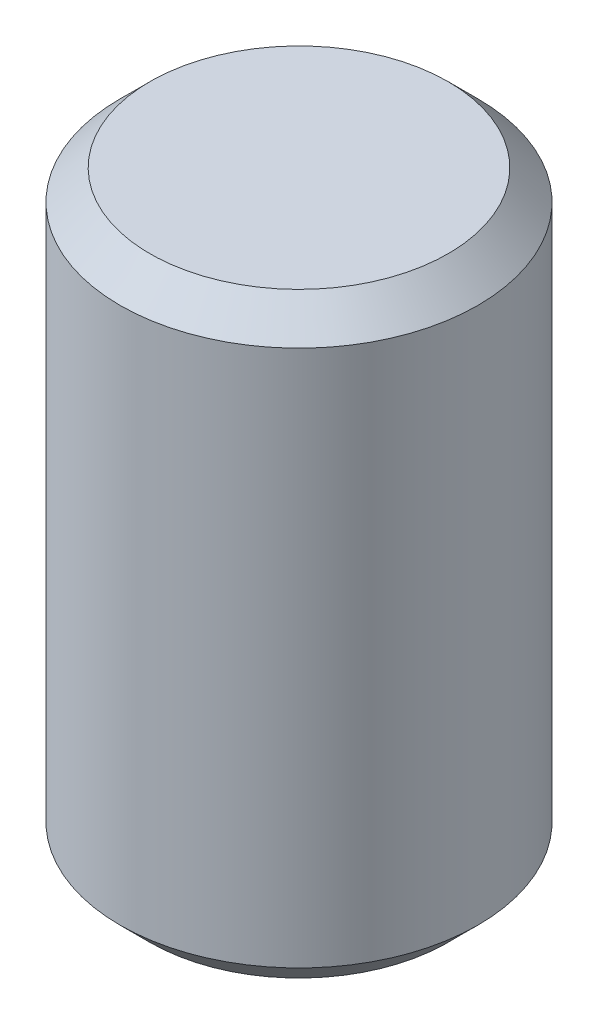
from build123d import *

# Parameters (mm, degrees)
ESQUISSE1_W             = 3
ESQUISSE1_H             = 10
CHANFREIN1_SIZE         = 0.5
ENL_V_MAT_EXTRU_1_DEPTH = 4


with BuildPart() as part:
    # Esquisse1 → Base-R_volution (revolve)
    with BuildSketch(Plane.XY, mode=Mode.PRIVATE) as base_r_volution_sk:
        with Locations((1.5, 5)):
            Rectangle(ESQUISSE1_W, ESQUISSE1_H)
    revolve(base_r_volution_sk.sketch.rotate(Axis((0, 10, 0), (0, -1, 0)), 90), axis=Axis((0, 10, 0), (0, -1, 0)))

    # Chanfrein1
    chanfrein1_edges = [part.edges().sort_by_distance(p)[0] for p in [
        (0, 10, -3),
        (0, 0, -3),
    ]]
    chamfer(chanfrein1_edges, length=CHANFREIN1_SIZE)

    # Esquisse2 → Enl_v. mat.-Extru.1 (cut)
    with BuildSketch(Plane.XZ):
        Polygon((0, -1.732050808), (1.5, -0.866025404), (1.5, 0.866025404), (0, 1.732050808), (-1.5, 0.866025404), (-1.5, -0.866025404), align=None)
    extrude(amount=-ENL_V_MAT_EXTRU_1_DEPTH, mode=Mode.SUBTRACT)


solid = part.part
